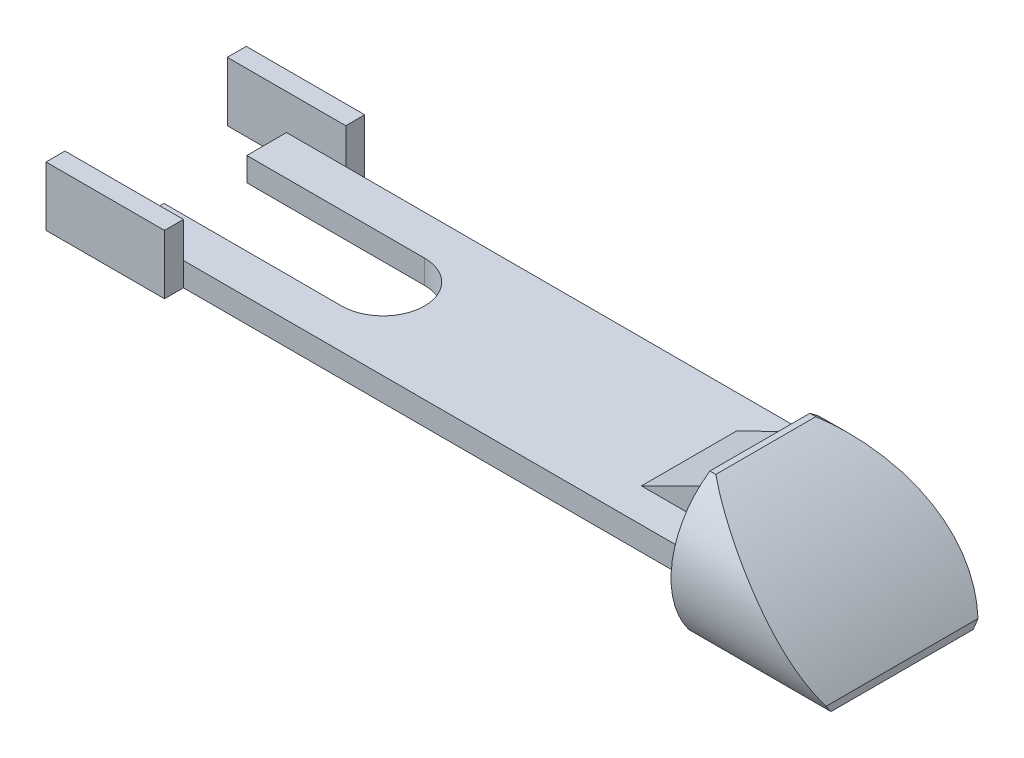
ISO-10303-21;
HEADER;
FILE_DESCRIPTION(('STEP AP214'),'2;1');
FILE_NAME('part.step','',(''),(''),'','','');
FILE_SCHEMA(('AUTOMOTIVE_DESIGN { 1 0 10303 214 1 1 1 1 }'));
ENDSEC;
DATA;
#1=APPLICATION_CONTEXT('core data for automotive mechanical design processes');
#2=APPLICATION_PROTOCOL_DEFINITION('international standard','automotive_design',2000,#1);
#3=PRODUCT_CONTEXT('',#1,'mechanical');
#4=PRODUCT('Part','Part','',(#3));
#5=PRODUCT_RELATED_PRODUCT_CATEGORY('part','',(#4));
#6=PRODUCT_DEFINITION_FORMATION('','',#4);
#7=PRODUCT_DEFINITION_CONTEXT('part definition',#1,'design');
#8=PRODUCT_DEFINITION('design','',#6,#7);
#9=PRODUCT_DEFINITION_SHAPE('','',#8);
#10=(LENGTH_UNIT() NAMED_UNIT(*) SI_UNIT(.MILLI.,.METRE.));
#11=(NAMED_UNIT(*) PLANE_ANGLE_UNIT() SI_UNIT($,.RADIAN.));
#12=(NAMED_UNIT(*) SI_UNIT($,.STERADIAN.) SOLID_ANGLE_UNIT());
#13=UNCERTAINTY_MEASURE_WITH_UNIT(LENGTH_MEASURE(1.E-05),#10,'distance_accuracy_value','');
#14=(GEOMETRIC_REPRESENTATION_CONTEXT(3) GLOBAL_UNCERTAINTY_ASSIGNED_CONTEXT((#13)) GLOBAL_UNIT_ASSIGNED_CONTEXT((#10,
#11,#12)) REPRESENTATION_CONTEXT('',''));
#15=CARTESIAN_POINT('',(0.,0.,0.));
#16=DIRECTION('',(0.,0.,1.));
#17=DIRECTION('',(1.,0.,0.));
#18=AXIS2_PLACEMENT_3D('',#15,#16,#17);
#19=CARTESIAN_POINT('',(44.958,0.,0.));
#20=DIRECTION('',(-1.,0.,0.));
#21=DIRECTION('',(0.,0.,1.));
#22=AXIS2_PLACEMENT_3D('',#19,#20,#21);
#23=CYLINDRICAL_SURFACE('',#22,9.525);
#24=CARTESIAN_POINT('',(30.353,7.87416386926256,5.3594));
#25=CARTESIAN_POINT('',(30.4711552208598,7.81522187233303,5.44599264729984));
#26=CARTESIAN_POINT('',(30.5898798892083,7.75522676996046,5.53107482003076));
#27=CARTESIAN_POINT('',(30.8282833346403,7.63316206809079,5.69835031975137));
#28=CARTESIAN_POINT('',(30.9479620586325,7.57109258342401,5.78054380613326));
#29=CARTESIAN_POINT('',(31.308113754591,7.38184070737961,6.02296434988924));
#30=CARTESIAN_POINT('',(31.5497596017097,7.2515863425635,6.17907326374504));
#31=CARTESIAN_POINT('',(32.035052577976,6.98304382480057,6.4810137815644));
#32=CARTESIAN_POINT('',(32.2787000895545,6.84475410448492,6.62684336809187));
#33=CARTESIAN_POINT('',(32.7671072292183,6.56024457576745,6.90861046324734));
#34=CARTESIAN_POINT('',(33.0118669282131,6.41402425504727,7.04454733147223));
#35=CARTESIAN_POINT('',(33.5038844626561,6.11242472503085,7.30782455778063));
#36=CARTESIAN_POINT('',(33.7511456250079,5.95697735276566,7.43508058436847));
#37=CARTESIAN_POINT('',(34.2454367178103,5.63812379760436,7.67968469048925));
#38=CARTESIAN_POINT('',(34.4924666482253,5.4747176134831,7.79703276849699));
#39=CARTESIAN_POINT('',(34.9857198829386,5.13999508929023,8.021638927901));
#40=CARTESIAN_POINT('',(35.231943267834,4.96867956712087,8.12889804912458));
#41=CARTESIAN_POINT('',(35.7230717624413,4.61818344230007,8.33301428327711));
#42=CARTESIAN_POINT('',(35.9679769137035,4.43900308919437,8.42987172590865));
#43=CARTESIAN_POINT('',(36.615350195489,3.95324570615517,8.67248355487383));
#44=CARTESIAN_POINT('',(37.0162989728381,3.63986845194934,8.80887717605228));
#45=CARTESIAN_POINT('',(37.8109947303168,2.99226483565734,9.04937884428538));
#46=CARTESIAN_POINT('',(38.204741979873,2.65803925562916,9.15348810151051));
#47=CARTESIAN_POINT('',(38.9817314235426,1.97048899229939,9.32566845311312));
#48=CARTESIAN_POINT('',(39.3649964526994,1.61721180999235,9.39382498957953));
#49=CARTESIAN_POINT('',(40.1192189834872,0.892545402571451,9.49012636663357));
#50=CARTESIAN_POINT('',(40.4901807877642,0.521162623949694,9.51828534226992));
#51=CARTESIAN_POINT('',(41.1134674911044,-0.129236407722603,9.52798760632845));
#52=CARTESIAN_POINT('',(41.3695511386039,-0.404512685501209,9.52050315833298));
#53=CARTESIAN_POINT('',(41.872621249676,-0.961562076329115,9.48045312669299));
#54=CARTESIAN_POINT('',(42.1196078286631,-1.24333510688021,9.44788786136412));
#55=CARTESIAN_POINT('',(42.6023924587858,-1.81067447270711,9.35571621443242));
#56=CARTESIAN_POINT('',(42.838220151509,-2.09622784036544,9.29618649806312));
#57=CARTESIAN_POINT('',(43.2978288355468,-2.66934219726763,9.14810373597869));
#58=CARTESIAN_POINT('',(43.5216150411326,-2.95690225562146,9.05956337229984));
#59=CARTESIAN_POINT('',(43.9563582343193,-3.53202480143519,8.85122460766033));
#60=CARTESIAN_POINT('',(44.1672752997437,-3.81958477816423,8.73133448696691));
#61=CARTESIAN_POINT('',(44.4723906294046,-4.24764006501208,8.52691519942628));
#62=CARTESIAN_POINT('',(44.572334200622,-4.38994953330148,8.45457463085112));
#63=CARTESIAN_POINT('',(44.7682182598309,-4.67287740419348,8.30154866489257));
#64=CARTESIAN_POINT('',(44.8641578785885,-4.81349543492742,8.22086146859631));
#65=CARTESIAN_POINT('',(44.958,-4.95299999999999,8.13593362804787));
#66=B_SPLINE_CURVE_WITH_KNOTS('',3,(#24,#25,#26,#27,#28,#29,#30,#31,#32,#33,#34,#35,#36,#37,#38,
#39,#40,#41,#42,#43,#44,#45,#46,#47,#48,#49,#50,#51,#52,#53,#54,#55,#56,#57,#58,#59,#60,#61,#62,
#63,#64,#65),.UNSPECIFIED.,.F.,.F.,(4,2,2,2,2,2,2,2,2,2,2,2,2,2,2,2,2,2,2,2,4),(0.,
0.473678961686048,0.947331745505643,1.89440808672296,2.84166978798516,3.78899275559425,
4.74449280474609,5.69999300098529,6.65539460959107,7.61076592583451,9.18986645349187,
10.7689077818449,12.3441793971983,13.9188941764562,15.0461534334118,16.1733983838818,
17.2974582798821,18.421027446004,19.5479213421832,20.1127498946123,20.677700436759),.UNSPECIFIED.);
#67=CARTESIAN_POINT('',(30.353,7.87416386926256,5.3594));
#68=VERTEX_POINT('',#67);
#69=CARTESIAN_POINT('',(44.958,-4.953,8.13593362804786));
#70=VERTEX_POINT('',#69);
#71=EDGE_CURVE('E241',#68,#70,#66,.T.);
#72=ORIENTED_EDGE('',*,*,#71,.F.);
#73=DIRECTION('',(-1.,0.,0.));
#74=VECTOR('',#73,1.);
#75=CARTESIAN_POINT('',(44.958,7.87416386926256,5.3594));
#76=LINE('',#75,#74);
#77=CARTESIAN_POINT('',(29.718,7.87416386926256,5.3594));
#78=VERTEX_POINT('',#77);
#79=EDGE_CURVE('E538',#68,#78,#76,.T.);
#80=ORIENTED_EDGE('',*,*,#79,.T.);
#81=CARTESIAN_POINT('',(29.718,0.,0.));
#82=DIRECTION('',(1.,0.,0.));
#83=DIRECTION('',(0.,0.,-1.));
#84=AXIS2_PLACEMENT_3D('',#81,#82,#83);
#85=CIRCLE('',#84,9.525);
#86=CARTESIAN_POINT('',(29.718,-5.715,7.62));
#87=VERTEX_POINT('',#86);
#88=EDGE_CURVE('E550',#78,#87,#85,.T.);
#89=ORIENTED_EDGE('',*,*,#88,.T.);
#90=DIRECTION('',(-1.,0.,0.));
#91=VECTOR('',#90,1.);
#92=CARTESIAN_POINT('',(44.958,-5.715,7.62));
#93=LINE('',#92,#91);
#94=CARTESIAN_POINT('',(44.958,-5.715,7.62));
#95=VERTEX_POINT('',#94);
#96=EDGE_CURVE('E473',#95,#87,#93,.T.);
#97=ORIENTED_EDGE('',*,*,#96,.F.);
#98=CARTESIAN_POINT('',(44.958,0.,0.));
#99=DIRECTION('',(1.,0.,0.));
#100=DIRECTION('',(0.,0.,-1.));
#101=AXIS2_PLACEMENT_3D('',#98,#99,#100);
#102=CIRCLE('',#101,9.525);
#103=EDGE_CURVE('E544',#70,#95,#102,.T.);
#104=ORIENTED_EDGE('',*,*,#103,.F.);
#105=EDGE_LOOP('',(#72,#80,#89,#97,#104));
#106=FACE_BOUND('',#105,.T.);
#107=ADVANCED_FACE('F32',(#106),#23,.T.);
#108=CARTESIAN_POINT('',(44.958,0.,0.));
#109=DIRECTION('',(-1.,0.,0.));
#110=DIRECTION('',(0.,0.,1.));
#111=AXIS2_PLACEMENT_3D('',#108,#109,#110);
#112=CYLINDRICAL_SURFACE('',#111,9.525);
#113=CARTESIAN_POINT('',(44.958,-4.95299999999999,-8.13593362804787));
#114=CARTESIAN_POINT('',(44.8555596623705,-4.80071180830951,-8.22864396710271));
#115=CARTESIAN_POINT('',(44.7506213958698,-4.64710154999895,-8.31629785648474));
#116=CARTESIAN_POINT('',(44.5359995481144,-4.33793147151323,-8.48166873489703));
#117=CARTESIAN_POINT('',(44.4263172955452,-4.18237220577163,-8.55938848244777));
#118=CARTESIAN_POINT('',(44.0909716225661,-3.71442206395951,-8.77763906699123));
#119=CARTESIAN_POINT('',(43.8585231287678,-3.40003313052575,-8.90369728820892));
#120=CARTESIAN_POINT('',(43.3809979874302,-2.77512849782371,-9.11767600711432));
#121=CARTESIAN_POINT('',(43.1361275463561,-2.46461621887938,-9.20607612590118));
#122=CARTESIAN_POINT('',(42.6327822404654,-1.84672505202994,-9.3496463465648));
#123=CARTESIAN_POINT('',(42.3742992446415,-1.53934817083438,-9.40479633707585));
#124=CARTESIAN_POINT('',(41.8043587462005,-0.883163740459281,-9.49060641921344));
#125=CARTESIAN_POINT('',(41.4909368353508,-0.535391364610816,-9.5160901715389));
#126=CARTESIAN_POINT('',(40.8511556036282,0.148647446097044,-9.52998367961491));
#127=CARTESIAN_POINT('',(40.5247959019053,0.484913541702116,-9.51839234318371));
#128=CARTESIAN_POINT('',(39.8595454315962,1.1455985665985,-9.46170074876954));
#129=CARTESIAN_POINT('',(39.5205945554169,1.46994031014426,-9.41641257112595));
#130=CARTESIAN_POINT('',(38.833969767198,2.10327866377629,-9.2954715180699));
#131=CARTESIAN_POINT('',(38.4862952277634,2.41227416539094,-9.2198164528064));
#132=CARTESIAN_POINT('',(37.66229577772,3.11829114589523,-9.01002780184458));
#133=CARTESIAN_POINT('',(37.1831377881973,3.50871303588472,-8.86471463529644));
#134=CARTESIAN_POINT('',(36.216242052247,4.25886692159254,-8.52974430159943));
#135=CARTESIAN_POINT('',(35.7285003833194,4.6185844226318,-8.34006634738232));
#136=CARTESIAN_POINT('',(34.7493883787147,5.30602806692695,-7.92045539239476));
#137=CARTESIAN_POINT('',(34.2580271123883,5.63381599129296,-7.6906026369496));
#138=CARTESIAN_POINT('',(33.5210737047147,6.1017129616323,-7.31672611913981));
#139=CARTESIAN_POINT('',(33.2754805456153,6.25368980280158,-7.18727639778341));
#140=CARTESIAN_POINT('',(32.7848980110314,6.54973011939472,-6.91857126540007));
#141=CARTESIAN_POINT('',(32.5399086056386,6.69379399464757,-6.77931635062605));
#142=CARTESIAN_POINT('',(31.9674074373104,7.02202454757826,-6.44125931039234));
#143=CARTESIAN_POINT('',(31.6404205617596,7.20299250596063,-6.2384187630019));
#144=CARTESIAN_POINT('',(31.1539373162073,7.46321866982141,-5.91985805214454));
#145=CARTESIAN_POINT('',(30.9926024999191,7.54801019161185,-5.81140394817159));
#146=CARTESIAN_POINT('',(30.6715076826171,7.71388815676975,-5.58933983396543));
#147=CARTESIAN_POINT('',(30.5117481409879,7.79497354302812,-5.47572837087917));
#148=CARTESIAN_POINT('',(30.353,7.87416386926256,-5.3594));
#149=B_SPLINE_CURVE_WITH_KNOTS('',3,(#113,#114,#115,#116,#117,#118,#119,#120,#121,#122,#123,
#124,#125,#126,#127,#128,#129,#130,#131,#132,#133,#134,#135,#136,#137,#138,#139,#140,#141,#142,
#143,#144,#145,#146,#147,#148),.UNSPECIFIED.,.F.,.F.,(4,2,2,2,2,2,2,2,2,2,2,2,2,2,2,2,2,4),(0.,
0.616688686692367,1.23320575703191,2.46332612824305,3.67727365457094,4.89195470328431,
6.29652739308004,7.70114146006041,9.11364801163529,10.5262564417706,12.4283549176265,
14.3313464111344,16.230579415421,17.1798617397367,18.1290960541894,19.4039986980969,
20.0401730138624,20.6765276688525),.UNSPECIFIED.);
#150=CARTESIAN_POINT('',(44.958,-4.953,-8.13593362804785));
#151=VERTEX_POINT('',#150);
#152=CARTESIAN_POINT('',(30.353,7.87416386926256,-5.3594));
#153=VERTEX_POINT('',#152);
#154=EDGE_CURVE('E233',#151,#153,#149,.T.);
#155=ORIENTED_EDGE('',*,*,#154,.F.);
#156=CARTESIAN_POINT('',(44.958,0.,0.));
#157=DIRECTION('',(1.,0.,0.));
#158=DIRECTION('',(0.,0.,-1.));
#159=AXIS2_PLACEMENT_3D('',#156,#157,#158);
#160=CIRCLE('',#159,9.525);
#161=CARTESIAN_POINT('',(44.958,-5.715,-7.62));
#162=VERTEX_POINT('',#161);
#163=EDGE_CURVE('E540',#162,#151,#160,.T.);
#164=ORIENTED_EDGE('',*,*,#163,.F.);
#165=DIRECTION('',(-1.,0.,0.));
#166=VECTOR('',#165,1.);
#167=CARTESIAN_POINT('',(44.958,-5.715,-7.62));
#168=LINE('',#167,#166);
#169=CARTESIAN_POINT('',(29.718,-5.715,-7.62));
#170=VERTEX_POINT('',#169);
#171=EDGE_CURVE('E533',#162,#170,#168,.T.);
#172=ORIENTED_EDGE('',*,*,#171,.T.);
#173=CARTESIAN_POINT('',(29.718,0.,0.));
#174=DIRECTION('',(1.,0.,0.));
#175=DIRECTION('',(0.,0.,-1.));
#176=AXIS2_PLACEMENT_3D('',#173,#174,#175);
#177=CIRCLE('',#176,9.525);
#178=CARTESIAN_POINT('',(29.718,7.87416386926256,-5.3594));
#179=VERTEX_POINT('',#178);
#180=EDGE_CURVE('E545',#170,#179,#177,.T.);
#181=ORIENTED_EDGE('',*,*,#180,.T.);
#182=DIRECTION('',(-1.,0.,0.));
#183=VECTOR('',#182,1.);
#184=CARTESIAN_POINT('',(44.958,7.87416386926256,-5.3594));
#185=LINE('',#184,#183);
#186=EDGE_CURVE('E536',#153,#179,#185,.T.);
#187=ORIENTED_EDGE('',*,*,#186,.F.);
#188=EDGE_LOOP('',(#155,#164,#172,#181,#187));
#189=FACE_BOUND('',#188,.T.);
#190=ADVANCED_FACE('F247',(#189),#112,.T.);
#191=CARTESIAN_POINT('',(44.958,7.87416386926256,5.3594));
#192=DIRECTION('',(0.,-1.,0.));
#193=DIRECTION('',(0.,0.,-1.));
#194=AXIS2_PLACEMENT_3D('',#191,#192,#193);
#195=PLANE('',#194);
#196=DIRECTION('',(0.,0.,-1.));
#197=VECTOR('',#196,1.);
#198=CARTESIAN_POINT('',(30.353,7.87416386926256,117.018032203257));
#199=LINE('',#198,#197);
#200=EDGE_CURVE('E230',#68,#153,#199,.T.);
#201=ORIENTED_EDGE('',*,*,#200,.T.);
#202=ORIENTED_EDGE('',*,*,#186,.T.);
#203=DIRECTION('',(0.,0.,1.));
#204=VECTOR('',#203,1.);
#205=CARTESIAN_POINT('',(29.718,7.87416386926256,5.3594));
#206=LINE('',#205,#204);
#207=EDGE_CURVE('E541',#179,#78,#206,.T.);
#208=ORIENTED_EDGE('',*,*,#207,.T.);
#209=ORIENTED_EDGE('',*,*,#79,.F.);
#210=EDGE_LOOP('',(#201,#202,#208,#209));
#211=FACE_BOUND('',#210,.T.);
#212=ADVANCED_FACE('F268',(#211),#195,.F.);
#213=CARTESIAN_POINT('',(-29.718,2.54,8.6995));
#214=DIRECTION('',(0.,0.,-1.));
#215=DIRECTION('',(-1.,0.,0.));
#216=AXIS2_PLACEMENT_3D('',#213,#214,#215);
#217=PLANE('',#216);
#218=DIRECTION('',(0.,1.,0.));
#219=VECTOR('',#218,1.);
#220=CARTESIAN_POINT('',(-23.368,0.,8.6995));
#221=LINE('',#220,#219);
#222=CARTESIAN_POINT('',(-23.368,0.,8.6995));
#223=VERTEX_POINT('',#222);
#224=CARTESIAN_POINT('',(-23.368,2.54,8.6995));
#225=VERTEX_POINT('',#224);
#226=EDGE_CURVE('E393',#223,#225,#221,.T.);
#227=ORIENTED_EDGE('',*,*,#226,.F.);
#228=DIRECTION('',(1.,0.,0.));
#229=VECTOR('',#228,1.);
#230=CARTESIAN_POINT('',(-29.718,0.,8.6995));
#231=LINE('',#230,#229);
#232=CARTESIAN_POINT('',(29.718,0.,8.6995));
#233=VERTEX_POINT('',#232);
#234=EDGE_CURVE('E208',#223,#233,#231,.T.);
#235=ORIENTED_EDGE('',*,*,#234,.T.);
#236=DIRECTION('',(0.,-1.,0.));
#237=VECTOR('',#236,1.);
#238=CARTESIAN_POINT('',(29.718,2.54,8.6995));
#239=LINE('',#238,#237);
#240=CARTESIAN_POINT('',(29.718,2.54,8.6995));
#241=VERTEX_POINT('',#240);
#242=EDGE_CURVE('E389',#241,#233,#239,.T.);
#243=ORIENTED_EDGE('',*,*,#242,.F.);
#244=DIRECTION('',(1.,0.,0.));
#245=VECTOR('',#244,1.);
#246=CARTESIAN_POINT('',(-29.718,2.54,8.6995));
#247=LINE('',#246,#245);
#248=EDGE_CURVE('E448',#225,#241,#247,.T.);
#249=ORIENTED_EDGE('',*,*,#248,.F.);
#250=EDGE_LOOP('',(#227,#235,#243,#249));
#251=FACE_BOUND('',#250,.T.);
#252=ADVANCED_FACE('F270',(#251),#217,.F.);
#253=CARTESIAN_POINT('',(-29.718,2.54,8.6995));
#254=DIRECTION('',(1.,0.,0.));
#255=DIRECTION('',(0.,0.,-1.));
#256=AXIS2_PLACEMENT_3D('',#253,#254,#255);
#257=PLANE('',#256);
#258=DIRECTION('',(0.,0.,1.));
#259=VECTOR('',#258,1.);
#260=CARTESIAN_POINT('',(-29.718,0.,8.6995));
#261=LINE('',#260,#259);
#262=CARTESIAN_POINT('',(-29.718,0.,-8.6995));
#263=VERTEX_POINT('',#262);
#264=CARTESIAN_POINT('',(-29.718,0.,-4.445));
#265=VERTEX_POINT('',#264);
#266=EDGE_CURVE('E36',#263,#265,#261,.T.);
#267=ORIENTED_EDGE('',*,*,#266,.T.);
#268=DIRECTION('',(0.,1.,0.));
#269=VECTOR('',#268,1.);
#270=CARTESIAN_POINT('',(-29.718,0.,-4.445));
#271=LINE('',#270,#269);
#272=CARTESIAN_POINT('',(-29.718,2.54,-4.445));
#273=VERTEX_POINT('',#272);
#274=EDGE_CURVE('E359',#265,#273,#271,.T.);
#275=ORIENTED_EDGE('',*,*,#274,.T.);
#276=DIRECTION('',(0.,0.,1.));
#277=VECTOR('',#276,1.);
#278=CARTESIAN_POINT('',(-29.718,2.54,8.6995));
#279=LINE('',#278,#277);
#280=CARTESIAN_POINT('',(-29.718,2.54,-8.6995));
#281=VERTEX_POINT('',#280);
#282=EDGE_CURVE('E446',#281,#273,#279,.T.);
#283=ORIENTED_EDGE('',*,*,#282,.F.);
#284=DIRECTION('',(0.,-1.,0.));
#285=VECTOR('',#284,1.);
#286=CARTESIAN_POINT('',(-29.718,2.54,-8.6995));
#287=LINE('',#286,#285);
#288=EDGE_CURVE('E361',#281,#263,#287,.T.);
#289=ORIENTED_EDGE('',*,*,#288,.T.);
#290=EDGE_LOOP('',(#267,#275,#283,#289));
#291=FACE_BOUND('',#290,.T.);
#292=ADVANCED_FACE('F276',(#291),#257,.F.);
#293=CARTESIAN_POINT('',(-29.718,2.54,-8.6995));
#294=DIRECTION('',(0.,0.,1.));
#295=DIRECTION('',(1.,0.,0.));
#296=AXIS2_PLACEMENT_3D('',#293,#294,#295);
#297=PLANE('',#296);
#298=DIRECTION('',(-1.,0.,0.));
#299=VECTOR('',#298,1.);
#300=CARTESIAN_POINT('',(-29.718,0.,-8.6995));
#301=LINE('',#300,#299);
#302=CARTESIAN_POINT('',(29.718,0.,-8.6995));
#303=VERTEX_POINT('',#302);
#304=CARTESIAN_POINT('',(-23.368,0.,-8.6995));
#305=VERTEX_POINT('',#304);
#306=EDGE_CURVE('E366',#303,#305,#301,.T.);
#307=ORIENTED_EDGE('',*,*,#306,.T.);
#308=DIRECTION('',(0.,1.,0.));
#309=VECTOR('',#308,1.);
#310=CARTESIAN_POINT('',(-23.368,0.,-8.6995));
#311=LINE('',#310,#309);
#312=CARTESIAN_POINT('',(-23.368,2.54,-8.6995));
#313=VERTEX_POINT('',#312);
#314=EDGE_CURVE('E465',#305,#313,#311,.T.);
#315=ORIENTED_EDGE('',*,*,#314,.T.);
#316=DIRECTION('',(-1.,0.,0.));
#317=VECTOR('',#316,1.);
#318=CARTESIAN_POINT('',(-29.718,2.54,-8.6995));
#319=LINE('',#318,#317);
#320=CARTESIAN_POINT('',(29.718,2.54,-8.6995));
#321=VERTEX_POINT('',#320);
#322=EDGE_CURVE('E443',#321,#313,#319,.T.);
#323=ORIENTED_EDGE('',*,*,#322,.F.);
#324=DIRECTION('',(0.,-1.,0.));
#325=VECTOR('',#324,1.);
#326=CARTESIAN_POINT('',(29.718,2.54,-8.6995));
#327=LINE('',#326,#325);
#328=EDGE_CURVE('E42',#321,#303,#327,.T.);
#329=ORIENTED_EDGE('',*,*,#328,.T.);
#330=EDGE_LOOP('',(#307,#315,#323,#329));
#331=FACE_BOUND('',#330,.T.);
#332=ADVANCED_FACE('F34',(#331),#297,.F.);
#333=CARTESIAN_POINT('',(-29.718,2.54,4.445));
#334=VERTEX_POINT('',#333);
#335=CARTESIAN_POINT('',(-29.718,2.54,8.6995));
#336=VERTEX_POINT('',#335);
#337=EDGE_CURVE('E445',#334,#336,#279,.T.);
#338=ORIENTED_EDGE('',*,*,#337,.F.);
#339=DIRECTION('',(0.,1.,0.));
#340=VECTOR('',#339,1.);
#341=CARTESIAN_POINT('',(-29.718,0.,4.445));
#342=LINE('',#341,#340);
#343=CARTESIAN_POINT('',(-29.718,0.,4.445));
#344=VERTEX_POINT('',#343);
#345=EDGE_CURVE('E428',#344,#334,#342,.T.);
#346=ORIENTED_EDGE('',*,*,#345,.F.);
#347=CARTESIAN_POINT('',(-29.718,0.,8.6995));
#348=VERTEX_POINT('',#347);
#349=EDGE_CURVE('E364',#344,#348,#261,.T.);
#350=ORIENTED_EDGE('',*,*,#349,.T.);
#351=DIRECTION('',(0.,-1.,0.));
#352=VECTOR('',#351,1.);
#353=CARTESIAN_POINT('',(-29.718,2.54,8.6995));
#354=LINE('',#353,#352);
#355=EDGE_CURVE('E379',#336,#348,#354,.T.);
#356=ORIENTED_EDGE('',*,*,#355,.F.);
#357=EDGE_LOOP('',(#338,#346,#350,#356));
#358=FACE_BOUND('',#357,.T.);
#359=ADVANCED_FACE('F340',(#358),#257,.F.);
#360=CARTESIAN_POINT('',(29.718,2.54,-8.6995));
#361=DIRECTION('',(0.,-1.,0.));
#362=DIRECTION('',(0.,0.,-1.));
#363=AXIS2_PLACEMENT_3D('',#360,#361,#362);
#364=PLANE('',#363);
#365=DIRECTION('',(0.,0.,-1.));
#366=VECTOR('',#365,1.);
#367=CARTESIAN_POINT('',(29.718,2.54,8.6995));
#368=LINE('',#367,#366);
#369=CARTESIAN_POINT('',(29.718,2.54,5.08));
#370=VERTEX_POINT('',#369);
#371=EDGE_CURVE('E207',#241,#370,#368,.T.);
#372=ORIENTED_EDGE('',*,*,#371,.T.);
#373=DIRECTION('',(-1.,0.,0.));
#374=VECTOR('',#373,1.);
#375=CARTESIAN_POINT('',(29.718,2.54,5.08));
#376=LINE('',#375,#374);
#377=CARTESIAN_POINT('',(22.098,2.54,5.08));
#378=VERTEX_POINT('',#377);
#379=EDGE_CURVE('E50',#370,#378,#376,.T.);
#380=ORIENTED_EDGE('',*,*,#379,.T.);
#381=DIRECTION('',(0.,0.,-1.));
#382=VECTOR('',#381,1.);
#383=CARTESIAN_POINT('',(22.098,2.54,-8.6995));
#384=LINE('',#383,#382);
#385=CARTESIAN_POINT('',(22.098,2.54,-5.08));
#386=VERTEX_POINT('',#385);
#387=EDGE_CURVE('E54',#378,#386,#384,.T.);
#388=ORIENTED_EDGE('',*,*,#387,.T.);
#389=DIRECTION('',(-1.,0.,0.));
#390=VECTOR('',#389,1.);
#391=CARTESIAN_POINT('',(29.718,2.54,-5.08));
#392=LINE('',#391,#390);
#393=CARTESIAN_POINT('',(29.718,2.54,-5.08));
#394=VERTEX_POINT('',#393);
#395=EDGE_CURVE('E210',#394,#386,#392,.T.);
#396=ORIENTED_EDGE('',*,*,#395,.F.);
#397=EDGE_CURVE('E199',#394,#321,#368,.T.);
#398=ORIENTED_EDGE('',*,*,#397,.T.);
#399=ORIENTED_EDGE('',*,*,#322,.T.);
#400=EDGE_CURVE('E442',#313,#281,#319,.T.);
#401=ORIENTED_EDGE('',*,*,#400,.T.);
#402=ORIENTED_EDGE('',*,*,#282,.T.);
#403=DIRECTION('',(-1.,0.,0.));
#404=VECTOR('',#403,1.);
#405=CARTESIAN_POINT('',(-29.718,2.54,-4.445));
#406=LINE('',#405,#404);
#407=CARTESIAN_POINT('',(-10.668,2.54,-4.445));
#408=VERTEX_POINT('',#407);
#409=EDGE_CURVE('E423',#408,#273,#406,.T.);
#410=ORIENTED_EDGE('',*,*,#409,.F.);
#411=CARTESIAN_POINT('',(-10.668,2.54,0.));
#412=DIRECTION('',(0.,1.,0.));
#413=DIRECTION('',(0.,0.,-1.));
#414=AXIS2_PLACEMENT_3D('',#411,#412,#413);
#415=CIRCLE('',#414,4.445);
#416=CARTESIAN_POINT('',(-10.668,2.54,4.445));
#417=VERTEX_POINT('',#416);
#418=EDGE_CURVE('E432',#417,#408,#415,.T.);
#419=ORIENTED_EDGE('',*,*,#418,.F.);
#420=DIRECTION('',(1.,0.,0.));
#421=VECTOR('',#420,1.);
#422=CARTESIAN_POINT('',(-29.718,2.54,4.445));
#423=LINE('',#422,#421);
#424=EDGE_CURVE('E429',#334,#417,#423,.T.);
#425=ORIENTED_EDGE('',*,*,#424,.F.);
#426=ORIENTED_EDGE('',*,*,#337,.T.);
#427=EDGE_CURVE('E449',#336,#225,#247,.T.);
#428=ORIENTED_EDGE('',*,*,#427,.T.);
#429=ORIENTED_EDGE('',*,*,#248,.T.);
#430=EDGE_LOOP('',(#372,#380,#388,#396,#398,#399,#401,#402,#410,#419,#425,#426,#428,#429));
#431=FACE_BOUND('',#430,.T.);
#432=ADVANCED_FACE('F211',(#431),#364,.F.);
#433=CARTESIAN_POINT('',(29.718,0.,-8.6995));
#434=DIRECTION('',(0.,-1.,0.));
#435=DIRECTION('',(0.,0.,-1.));
#436=AXIS2_PLACEMENT_3D('',#433,#434,#435);
#437=PLANE('',#436);
#438=ORIENTED_EDGE('',*,*,#306,.F.);
#439=DIRECTION('',(0.,0.,-1.));
#440=VECTOR('',#439,1.);
#441=CARTESIAN_POINT('',(29.718,0.,8.6995));
#442=LINE('',#441,#440);
#443=EDGE_CURVE('E373',#233,#303,#442,.T.);
#444=ORIENTED_EDGE('',*,*,#443,.F.);
#445=ORIENTED_EDGE('',*,*,#234,.F.);
#446=DIRECTION('',(0.,0.,-1.));
#447=VECTOR('',#446,1.);
#448=CARTESIAN_POINT('',(-23.368,0.,10.7315));
#449=LINE('',#448,#447);
#450=CARTESIAN_POINT('',(-23.368,0.,10.7315));
#451=VERTEX_POINT('',#450);
#452=EDGE_CURVE('E398',#451,#223,#449,.T.);
#453=ORIENTED_EDGE('',*,*,#452,.F.);
#454=DIRECTION('',(1.,0.,0.));
#455=VECTOR('',#454,1.);
#456=CARTESIAN_POINT('',(-23.368,0.,10.7315));
#457=LINE('',#456,#455);
#458=CARTESIAN_POINT('',(-36.068,0.,10.7315));
#459=VERTEX_POINT('',#458);
#460=EDGE_CURVE('E403',#459,#451,#457,.T.);
#461=ORIENTED_EDGE('',*,*,#460,.F.);
#462=DIRECTION('',(0.,0.,-1.));
#463=VECTOR('',#462,1.);
#464=CARTESIAN_POINT('',(-36.068,0.,10.7315));
#465=LINE('',#464,#463);
#466=CARTESIAN_POINT('',(-36.068,0.,8.6995));
#467=VERTEX_POINT('',#466);
#468=EDGE_CURVE('E411',#459,#467,#465,.T.);
#469=ORIENTED_EDGE('',*,*,#468,.T.);
#470=DIRECTION('',(1.,0.,0.));
#471=VECTOR('',#470,1.);
#472=CARTESIAN_POINT('',(-23.368,0.,8.6995));
#473=LINE('',#472,#471);
#474=EDGE_CURVE('E408',#467,#348,#473,.T.);
#475=ORIENTED_EDGE('',*,*,#474,.T.);
#476=ORIENTED_EDGE('',*,*,#349,.F.);
#477=DIRECTION('',(1.,0.,0.));
#478=VECTOR('',#477,1.);
#479=CARTESIAN_POINT('',(-29.718,0.,4.445));
#480=LINE('',#479,#478);
#481=CARTESIAN_POINT('',(-10.668,0.,4.445));
#482=VERTEX_POINT('',#481);
#483=EDGE_CURVE('E419',#344,#482,#480,.T.);
#484=ORIENTED_EDGE('',*,*,#483,.T.);
#485=CARTESIAN_POINT('',(-10.668,0.,0.));
#486=DIRECTION('',(0.,1.,0.));
#487=DIRECTION('',(0.,0.,-1.));
#488=AXIS2_PLACEMENT_3D('',#485,#486,#487);
#489=CIRCLE('',#488,4.445);
#490=CARTESIAN_POINT('',(-10.668,0.,-4.445));
#491=VERTEX_POINT('',#490);
#492=EDGE_CURVE('E422',#482,#491,#489,.T.);
#493=ORIENTED_EDGE('',*,*,#492,.T.);
#494=DIRECTION('',(-1.,0.,0.));
#495=VECTOR('',#494,1.);
#496=CARTESIAN_POINT('',(-29.718,0.,-4.445));
#497=LINE('',#496,#495);
#498=EDGE_CURVE('E426',#491,#265,#497,.T.);
#499=ORIENTED_EDGE('',*,*,#498,.T.);
#500=ORIENTED_EDGE('',*,*,#266,.F.);
#501=DIRECTION('',(1.,0.,0.));
#502=VECTOR('',#501,1.);
#503=CARTESIAN_POINT('',(-23.368,0.,-8.6995));
#504=LINE('',#503,#502);
#505=CARTESIAN_POINT('',(-36.068,0.,-8.6995));
#506=VERTEX_POINT('',#505);
#507=EDGE_CURVE('E469',#506,#263,#504,.T.);
#508=ORIENTED_EDGE('',*,*,#507,.F.);
#509=DIRECTION('',(0.,0.,1.));
#510=VECTOR('',#509,1.);
#511=CARTESIAN_POINT('',(-36.068,0.,-10.7315));
#512=LINE('',#511,#510);
#513=CARTESIAN_POINT('',(-36.068,0.,-10.7315));
#514=VERTEX_POINT('',#513);
#515=EDGE_CURVE('E463',#514,#506,#512,.T.);
#516=ORIENTED_EDGE('',*,*,#515,.F.);
#517=DIRECTION('',(1.,0.,0.));
#518=VECTOR('',#517,1.);
#519=CARTESIAN_POINT('',(-23.368,0.,-10.7315));
#520=LINE('',#519,#518);
#521=CARTESIAN_POINT('',(-23.368,0.,-10.7315));
#522=VERTEX_POINT('',#521);
#523=EDGE_CURVE('E460',#514,#522,#520,.T.);
#524=ORIENTED_EDGE('',*,*,#523,.T.);
#525=DIRECTION('',(0.,0.,1.));
#526=VECTOR('',#525,1.);
#527=CARTESIAN_POINT('',(-23.368,0.,-10.7315));
#528=LINE('',#527,#526);
#529=EDGE_CURVE('E402',#522,#305,#528,.T.);
#530=ORIENTED_EDGE('',*,*,#529,.T.);
#531=EDGE_LOOP('',(#438,#444,#445,#453,#461,#469,#475,#476,#484,#493,#499,#500,#508,#516,#524,#530));
#532=FACE_BOUND('',#531,.T.);
#533=ADVANCED_FACE('F330',(#532),#437,.T.);
#534=CARTESIAN_POINT('',(-29.718,0.,-4.445));
#535=DIRECTION('',(0.,0.,-1.));
#536=DIRECTION('',(-1.,0.,0.));
#537=AXIS2_PLACEMENT_3D('',#534,#535,#536);
#538=PLANE('',#537);
#539=ORIENTED_EDGE('',*,*,#409,.T.);
#540=ORIENTED_EDGE('',*,*,#274,.F.);
#541=ORIENTED_EDGE('',*,*,#498,.F.);
#542=DIRECTION('',(0.,1.,0.));
#543=VECTOR('',#542,1.);
#544=CARTESIAN_POINT('',(-10.668,0.,-4.445));
#545=LINE('',#544,#543);
#546=EDGE_CURVE('E437',#491,#408,#545,.T.);
#547=ORIENTED_EDGE('',*,*,#546,.T.);
#548=EDGE_LOOP('',(#539,#540,#541,#547));
#549=FACE_BOUND('',#548,.T.);
#550=ADVANCED_FACE('F326',(#549),#538,.F.);
#551=CARTESIAN_POINT('',(-10.668,0.,0.));
#552=DIRECTION('',(0.,1.,0.));
#553=DIRECTION('',(0.,0.,1.));
#554=AXIS2_PLACEMENT_3D('',#551,#552,#553);
#555=CYLINDRICAL_SURFACE('',#554,4.445);
#556=ORIENTED_EDGE('',*,*,#418,.T.);
#557=ORIENTED_EDGE('',*,*,#546,.F.);
#558=ORIENTED_EDGE('',*,*,#492,.F.);
#559=DIRECTION('',(0.,1.,0.));
#560=VECTOR('',#559,1.);
#561=CARTESIAN_POINT('',(-10.668,0.,4.445));
#562=LINE('',#561,#560);
#563=EDGE_CURVE('E439',#482,#417,#562,.T.);
#564=ORIENTED_EDGE('',*,*,#563,.T.);
#565=EDGE_LOOP('',(#556,#557,#558,#564));
#566=FACE_BOUND('',#565,.T.);
#567=ADVANCED_FACE('F329',(#566),#555,.F.);
#568=CARTESIAN_POINT('',(-29.718,0.,4.445));
#569=DIRECTION('',(0.,0.,1.));
#570=DIRECTION('',(1.,0.,0.));
#571=AXIS2_PLACEMENT_3D('',#568,#569,#570);
#572=PLANE('',#571);
#573=ORIENTED_EDGE('',*,*,#424,.T.);
#574=ORIENTED_EDGE('',*,*,#563,.F.);
#575=ORIENTED_EDGE('',*,*,#483,.F.);
#576=ORIENTED_EDGE('',*,*,#345,.T.);
#577=EDGE_LOOP('',(#573,#574,#575,#576));
#578=FACE_BOUND('',#577,.T.);
#579=ADVANCED_FACE('F324',(#578),#572,.F.);
#580=CARTESIAN_POINT('',(-23.368,0.,10.7315));
#581=DIRECTION('',(-1.,0.,0.));
#582=DIRECTION('',(0.,0.,1.));
#583=AXIS2_PLACEMENT_3D('',#580,#581,#582);
#584=PLANE('',#583);
#585=ORIENTED_EDGE('',*,*,#226,.T.);
#586=CARTESIAN_POINT('',(-23.368,6.35,8.6995));
#587=VERTEX_POINT('',#586);
#588=EDGE_CURVE('E397',#225,#587,#221,.T.);
#589=ORIENTED_EDGE('',*,*,#588,.T.);
#590=DIRECTION('',(0.,0.,-1.));
#591=VECTOR('',#590,1.);
#592=CARTESIAN_POINT('',(-23.368,6.35,10.7315));
#593=LINE('',#592,#591);
#594=CARTESIAN_POINT('',(-23.368,6.35,10.7315));
#595=VERTEX_POINT('',#594);
#596=EDGE_CURVE('E418',#595,#587,#593,.T.);
#597=ORIENTED_EDGE('',*,*,#596,.F.);
#598=DIRECTION('',(0.,1.,0.));
#599=VECTOR('',#598,1.);
#600=CARTESIAN_POINT('',(-23.368,0.,10.7315));
#601=LINE('',#600,#599);
#602=EDGE_CURVE('E417',#451,#595,#601,.T.);
#603=ORIENTED_EDGE('',*,*,#602,.F.);
#604=ORIENTED_EDGE('',*,*,#452,.T.);
#605=EDGE_LOOP('',(#585,#589,#597,#603,#604));
#606=FACE_BOUND('',#605,.T.);
#607=ADVANCED_FACE('F320',(#606),#584,.F.);
#608=CARTESIAN_POINT('',(-23.368,6.35,10.7315));
#609=DIRECTION('',(0.,-1.,0.));
#610=DIRECTION('',(1.,0.,0.));
#611=AXIS2_PLACEMENT_3D('',#608,#609,#610);
#612=PLANE('',#611);
#613=DIRECTION('',(-1.,0.,0.));
#614=VECTOR('',#613,1.);
#615=CARTESIAN_POINT('',(-23.368,6.35,8.6995));
#616=LINE('',#615,#614);
#617=CARTESIAN_POINT('',(-36.068,6.35,8.6995));
#618=VERTEX_POINT('',#617);
#619=EDGE_CURVE('E396',#587,#618,#616,.T.);
#620=ORIENTED_EDGE('',*,*,#619,.T.);
#621=DIRECTION('',(0.,0.,-1.));
#622=VECTOR('',#621,1.);
#623=CARTESIAN_POINT('',(-36.068,6.35,10.7315));
#624=LINE('',#623,#622);
#625=CARTESIAN_POINT('',(-36.068,6.35,10.7315));
#626=VERTEX_POINT('',#625);
#627=EDGE_CURVE('E499',#626,#618,#624,.T.);
#628=ORIENTED_EDGE('',*,*,#627,.F.);
#629=DIRECTION('',(-1.,0.,0.));
#630=VECTOR('',#629,1.);
#631=CARTESIAN_POINT('',(-23.368,6.35,10.7315));
#632=LINE('',#631,#630);
#633=EDGE_CURVE('E490',#595,#626,#632,.T.);
#634=ORIENTED_EDGE('',*,*,#633,.F.);
#635=ORIENTED_EDGE('',*,*,#596,.T.);
#636=EDGE_LOOP('',(#620,#628,#634,#635));
#637=FACE_BOUND('',#636,.T.);
#638=ADVANCED_FACE('F316',(#637),#612,.F.);
#639=CARTESIAN_POINT('',(-36.068,0.,10.7315));
#640=DIRECTION('',(1.,0.,0.));
#641=DIRECTION('',(0.,0.,-1.));
#642=AXIS2_PLACEMENT_3D('',#639,#640,#641);
#643=PLANE('',#642);
#644=DIRECTION('',(0.,-1.,0.));
#645=VECTOR('',#644,1.);
#646=CARTESIAN_POINT('',(-36.068,0.,8.6995));
#647=LINE('',#646,#645);
#648=EDGE_CURVE('E406',#618,#467,#647,.T.);
#649=ORIENTED_EDGE('',*,*,#648,.T.);
#650=ORIENTED_EDGE('',*,*,#468,.F.);
#651=DIRECTION('',(0.,-1.,0.));
#652=VECTOR('',#651,1.);
#653=CARTESIAN_POINT('',(-36.068,0.,10.7315));
#654=LINE('',#653,#652);
#655=EDGE_CURVE('E491',#626,#459,#654,.T.);
#656=ORIENTED_EDGE('',*,*,#655,.F.);
#657=ORIENTED_EDGE('',*,*,#627,.T.);
#658=EDGE_LOOP('',(#649,#650,#656,#657));
#659=FACE_BOUND('',#658,.T.);
#660=ADVANCED_FACE('F309',(#659),#643,.F.);
#661=CARTESIAN_POINT('',(-23.368,6.35,10.7315));
#662=DIRECTION('',(0.,0.,1.));
#663=DIRECTION('',(1.,0.,0.));
#664=AXIS2_PLACEMENT_3D('',#661,#662,#663);
#665=PLANE('',#664);
#666=ORIENTED_EDGE('',*,*,#602,.T.);
#667=ORIENTED_EDGE('',*,*,#633,.T.);
#668=ORIENTED_EDGE('',*,*,#655,.T.);
#669=ORIENTED_EDGE('',*,*,#460,.T.);
#670=EDGE_LOOP('',(#666,#667,#668,#669));
#671=FACE_BOUND('',#670,.T.);
#672=ADVANCED_FACE('F306',(#671),#665,.T.);
#673=CARTESIAN_POINT('',(-23.368,6.35,8.6995));
#674=DIRECTION('',(0.,0.,1.));
#675=DIRECTION('',(1.,0.,0.));
#676=AXIS2_PLACEMENT_3D('',#673,#674,#675);
#677=PLANE('',#676);
#678=ORIENTED_EDGE('',*,*,#427,.F.);
#679=ORIENTED_EDGE('',*,*,#355,.T.);
#680=ORIENTED_EDGE('',*,*,#474,.F.);
#681=ORIENTED_EDGE('',*,*,#648,.F.);
#682=ORIENTED_EDGE('',*,*,#619,.F.);
#683=ORIENTED_EDGE('',*,*,#588,.F.);
#684=EDGE_LOOP('',(#678,#679,#680,#681,#682,#683));
#685=FACE_BOUND('',#684,.T.);
#686=ADVANCED_FACE('F304',(#685),#677,.F.);
#687=CARTESIAN_POINT('',(-23.368,0.,-10.7315));
#688=DIRECTION('',(1.,0.,0.));
#689=DIRECTION('',(0.,0.,-1.));
#690=AXIS2_PLACEMENT_3D('',#687,#688,#689);
#691=PLANE('',#690);
#692=ORIENTED_EDGE('',*,*,#314,.F.);
#693=ORIENTED_EDGE('',*,*,#529,.F.);
#694=DIRECTION('',(0.,1.,0.));
#695=VECTOR('',#694,1.);
#696=CARTESIAN_POINT('',(-23.368,0.,-10.7315));
#697=LINE('',#696,#695);
#698=CARTESIAN_POINT('',(-23.368,6.35,-10.7315));
#699=VERTEX_POINT('',#698);
#700=EDGE_CURVE('E525',#522,#699,#697,.T.);
#701=ORIENTED_EDGE('',*,*,#700,.T.);
#702=DIRECTION('',(0.,0.,1.));
#703=VECTOR('',#702,1.);
#704=CARTESIAN_POINT('',(-23.368,6.35,-10.7315));
#705=LINE('',#704,#703);
#706=CARTESIAN_POINT('',(-23.368,6.35,-8.6995));
#707=VERTEX_POINT('',#706);
#708=EDGE_CURVE('E527',#699,#707,#705,.T.);
#709=ORIENTED_EDGE('',*,*,#708,.T.);
#710=EDGE_CURVE('E467',#313,#707,#311,.T.);
#711=ORIENTED_EDGE('',*,*,#710,.F.);
#712=EDGE_LOOP('',(#692,#693,#701,#709,#711));
#713=FACE_BOUND('',#712,.T.);
#714=ADVANCED_FACE('F300',(#713),#691,.T.);
#715=CARTESIAN_POINT('',(-36.068,0.,-10.7315));
#716=DIRECTION('',(-1.,0.,0.));
#717=DIRECTION('',(0.,0.,1.));
#718=AXIS2_PLACEMENT_3D('',#715,#716,#717);
#719=PLANE('',#718);
#720=DIRECTION('',(0.,-1.,0.));
#721=VECTOR('',#720,1.);
#722=CARTESIAN_POINT('',(-36.068,0.,-8.6995));
#723=LINE('',#722,#721);
#724=CARTESIAN_POINT('',(-36.068,6.35,-8.6995));
#725=VERTEX_POINT('',#724);
#726=EDGE_CURVE('E471',#725,#506,#723,.T.);
#727=ORIENTED_EDGE('',*,*,#726,.F.);
#728=DIRECTION('',(0.,0.,1.));
#729=VECTOR('',#728,1.);
#730=CARTESIAN_POINT('',(-36.068,6.35,-10.7315));
#731=LINE('',#730,#729);
#732=CARTESIAN_POINT('',(-36.068,6.35,-10.7315));
#733=VERTEX_POINT('',#732);
#734=EDGE_CURVE('E520',#733,#725,#731,.T.);
#735=ORIENTED_EDGE('',*,*,#734,.F.);
#736=DIRECTION('',(0.,-1.,0.));
#737=VECTOR('',#736,1.);
#738=CARTESIAN_POINT('',(-36.068,0.,-10.7315));
#739=LINE('',#738,#737);
#740=EDGE_CURVE('E523',#733,#514,#739,.T.);
#741=ORIENTED_EDGE('',*,*,#740,.T.);
#742=ORIENTED_EDGE('',*,*,#515,.T.);
#743=EDGE_LOOP('',(#727,#735,#741,#742));
#744=FACE_BOUND('',#743,.T.);
#745=ADVANCED_FACE('F296',(#744),#719,.T.);
#746=CARTESIAN_POINT('',(-23.368,6.35,-10.7315));
#747=DIRECTION('',(0.,1.,0.));
#748=DIRECTION('',(-1.,0.,0.));
#749=AXIS2_PLACEMENT_3D('',#746,#747,#748);
#750=PLANE('',#749);
#751=DIRECTION('',(-1.,0.,0.));
#752=VECTOR('',#751,1.);
#753=CARTESIAN_POINT('',(-23.368,6.35,-8.6995));
#754=LINE('',#753,#752);
#755=EDGE_CURVE('E530',#707,#725,#754,.T.);
#756=ORIENTED_EDGE('',*,*,#755,.F.);
#757=ORIENTED_EDGE('',*,*,#708,.F.);
#758=DIRECTION('',(-1.,0.,0.));
#759=VECTOR('',#758,1.);
#760=CARTESIAN_POINT('',(-23.368,6.35,-10.7315));
#761=LINE('',#760,#759);
#762=EDGE_CURVE('E480',#699,#733,#761,.T.);
#763=ORIENTED_EDGE('',*,*,#762,.T.);
#764=ORIENTED_EDGE('',*,*,#734,.T.);
#765=EDGE_LOOP('',(#756,#757,#763,#764));
#766=FACE_BOUND('',#765,.T.);
#767=ADVANCED_FACE('F289',(#766),#750,.T.);
#768=CARTESIAN_POINT('',(-23.368,6.35,-10.7315));
#769=DIRECTION('',(0.,0.,-1.));
#770=DIRECTION('',(1.,0.,0.));
#771=AXIS2_PLACEMENT_3D('',#768,#769,#770);
#772=PLANE('',#771);
#773=ORIENTED_EDGE('',*,*,#700,.F.);
#774=ORIENTED_EDGE('',*,*,#523,.F.);
#775=ORIENTED_EDGE('',*,*,#740,.F.);
#776=ORIENTED_EDGE('',*,*,#762,.F.);
#777=EDGE_LOOP('',(#773,#774,#775,#776));
#778=FACE_BOUND('',#777,.T.);
#779=ADVANCED_FACE('F286',(#778),#772,.T.);
#780=CARTESIAN_POINT('',(-23.368,6.35,-8.6995));
#781=DIRECTION('',(0.,0.,-1.));
#782=DIRECTION('',(1.,0.,0.));
#783=AXIS2_PLACEMENT_3D('',#780,#781,#782);
#784=PLANE('',#783);
#785=ORIENTED_EDGE('',*,*,#288,.F.);
#786=ORIENTED_EDGE('',*,*,#400,.F.);
#787=ORIENTED_EDGE('',*,*,#710,.T.);
#788=ORIENTED_EDGE('',*,*,#755,.T.);
#789=ORIENTED_EDGE('',*,*,#726,.T.);
#790=ORIENTED_EDGE('',*,*,#507,.T.);
#791=EDGE_LOOP('',(#785,#786,#787,#788,#789,#790));
#792=FACE_BOUND('',#791,.T.);
#793=ADVANCED_FACE('F266',(#792),#784,.F.);
#794=CARTESIAN_POINT('',(29.718,0.,0.));
#795=DIRECTION('',(1.,0.,0.));
#796=DIRECTION('',(0.,0.,-1.));
#797=AXIS2_PLACEMENT_3D('',#794,#795,#796);
#798=PLANE('',#797);
#799=ORIENTED_EDGE('',*,*,#180,.F.);
#800=DIRECTION('',(0.,0.,-1.));
#801=VECTOR('',#800,1.);
#802=CARTESIAN_POINT('',(29.718,-5.715,7.62));
#803=LINE('',#802,#801);
#804=EDGE_CURVE('E548',#87,#170,#803,.T.);
#805=ORIENTED_EDGE('',*,*,#804,.F.);
#806=ORIENTED_EDGE('',*,*,#88,.F.);
#807=ORIENTED_EDGE('',*,*,#207,.F.);
#808=EDGE_LOOP('',(#799,#805,#806,#807));
#809=FACE_BOUND('',#808,.T.);
#810=ORIENTED_EDGE('',*,*,#443,.T.);
#811=ORIENTED_EDGE('',*,*,#328,.F.);
#812=ORIENTED_EDGE('',*,*,#397,.F.);
#813=DIRECTION('',(0.,-1.,0.));
#814=VECTOR('',#813,1.);
#815=CARTESIAN_POINT('',(29.718,0.,-5.08));
#816=LINE('',#815,#814);
#817=CARTESIAN_POINT('',(29.718,6.3266450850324,-5.08));
#818=VERTEX_POINT('',#817);
#819=EDGE_CURVE('E202',#818,#394,#816,.T.);
#820=ORIENTED_EDGE('',*,*,#819,.F.);
#821=DIRECTION('',(0.,0.,1.));
#822=VECTOR('',#821,1.);
#823=CARTESIAN_POINT('',(29.718,6.3266450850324,0.));
#824=LINE('',#823,#822);
#825=CARTESIAN_POINT('',(29.718,6.3266450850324,5.08));
#826=VERTEX_POINT('',#825);
#827=EDGE_CURVE('E228',#818,#826,#824,.T.);
#828=ORIENTED_EDGE('',*,*,#827,.T.);
#829=DIRECTION('',(0.,-1.,0.));
#830=VECTOR('',#829,1.);
#831=CARTESIAN_POINT('',(29.718,0.,5.08));
#832=LINE('',#831,#830);
#833=EDGE_CURVE('E215',#826,#370,#832,.T.);
#834=ORIENTED_EDGE('',*,*,#833,.T.);
#835=ORIENTED_EDGE('',*,*,#371,.F.);
#836=ORIENTED_EDGE('',*,*,#242,.T.);
#837=EDGE_LOOP('',(#810,#811,#812,#820,#828,#834,#835,#836));
#838=FACE_BOUND('',#837,.T.);
#839=ADVANCED_FACE('F200',(#809,#838),#798,.F.);
#840=CARTESIAN_POINT('',(44.958,-5.715,7.62));
#841=DIRECTION('',(0.,1.,0.));
#842=DIRECTION('',(0.,0.,1.));
#843=AXIS2_PLACEMENT_3D('',#840,#841,#842);
#844=PLANE('',#843);
#845=ORIENTED_EDGE('',*,*,#804,.T.);
#846=ORIENTED_EDGE('',*,*,#171,.F.);
#847=DIRECTION('',(0.,0.,-1.));
#848=VECTOR('',#847,1.);
#849=CARTESIAN_POINT('',(44.958,-5.715,7.62));
#850=LINE('',#849,#848);
#851=EDGE_CURVE('E555',#95,#162,#850,.T.);
#852=ORIENTED_EDGE('',*,*,#851,.F.);
#853=ORIENTED_EDGE('',*,*,#96,.T.);
#854=EDGE_LOOP('',(#845,#846,#852,#853));
#855=FACE_BOUND('',#854,.T.);
#856=ADVANCED_FACE('F263',(#855),#844,.F.);
#857=CARTESIAN_POINT('',(44.958,0.,0.));
#858=DIRECTION('',(1.,0.,0.));
#859=DIRECTION('',(0.,0.,-1.));
#860=AXIS2_PLACEMENT_3D('',#857,#858,#859);
#861=PLANE('',#860);
#862=ORIENTED_EDGE('',*,*,#851,.T.);
#863=ORIENTED_EDGE('',*,*,#163,.T.);
#864=DIRECTION('',(0.,0.,-1.));
#865=VECTOR('',#864,1.);
#866=CARTESIAN_POINT('',(44.958,-4.953,117.018032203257));
#867=LINE('',#866,#865);
#868=EDGE_CURVE('E11',#70,#151,#867,.T.);
#869=ORIENTED_EDGE('',*,*,#868,.F.);
#870=ORIENTED_EDGE('',*,*,#103,.T.);
#871=EDGE_LOOP('',(#862,#863,#869,#870));
#872=FACE_BOUND('',#871,.T.);
#873=ADVANCED_FACE('F257',(#872),#861,.T.);
#874=CARTESIAN_POINT('',(13.3452583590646,-26.2190425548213,117.018032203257));
#875=DIRECTION('',(0.,0.,-1.));
#876=DIRECTION('',(-1.,0.,0.));
#877=AXIS2_PLACEMENT_3D('',#874,#875,#876);
#878=CYLINDRICAL_SURFACE('',#877,38.1);
#879=ORIENTED_EDGE('',*,*,#868,.T.);
#880=ORIENTED_EDGE('',*,*,#154,.T.);
#881=ORIENTED_EDGE('',*,*,#200,.F.);
#882=ORIENTED_EDGE('',*,*,#71,.T.);
#883=EDGE_LOOP('',(#879,#880,#881,#882));
#884=FACE_BOUND('',#883,.T.);
#885=ADVANCED_FACE('F251',(#884),#878,.T.);
#886=CARTESIAN_POINT('',(29.718,6.3266450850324,0.));
#887=DIRECTION('',(-0.445016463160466,0.895522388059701,0.));
#888=DIRECTION('',(-0.895522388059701,-0.445016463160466,0.));
#889=AXIS2_PLACEMENT_3D('',#886,#887,#888);
#890=PLANE('',#889);
#891=ORIENTED_EDGE('',*,*,#387,.F.);
#892=DIRECTION('',(-0.895522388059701,-0.445016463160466,0.));
#893=VECTOR('',#892,1.);
#894=CARTESIAN_POINT('',(29.718,6.3266450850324,5.08));
#895=LINE('',#894,#893);
#896=EDGE_CURVE('E219',#826,#378,#895,.T.);
#897=ORIENTED_EDGE('',*,*,#896,.F.);
#898=ORIENTED_EDGE('',*,*,#827,.F.);
#899=DIRECTION('',(-0.895522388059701,-0.445016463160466,0.));
#900=VECTOR('',#899,1.);
#901=CARTESIAN_POINT('',(29.718,6.3266450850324,-5.08));
#902=LINE('',#901,#900);
#903=EDGE_CURVE('E218',#818,#386,#902,.T.);
#904=ORIENTED_EDGE('',*,*,#903,.T.);
#905=EDGE_LOOP('',(#891,#897,#898,#904));
#906=FACE_BOUND('',#905,.T.);
#907=ADVANCED_FACE('F256',(#906),#890,.T.);
#908=CARTESIAN_POINT('',(4.4449875,1.07958193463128,5.08));
#909=DIRECTION('',(0.,0.,1.));
#910=DIRECTION('',(1.,0.,0.));
#911=AXIS2_PLACEMENT_3D('',#908,#909,#910);
#912=PLANE('',#911);
#913=ORIENTED_EDGE('',*,*,#379,.F.);
#914=ORIENTED_EDGE('',*,*,#833,.F.);
#915=ORIENTED_EDGE('',*,*,#896,.T.);
#916=EDGE_LOOP('',(#913,#914,#915));
#917=FACE_BOUND('',#916,.T.);
#918=ADVANCED_FACE('F589',(#917),#912,.T.);
#919=CARTESIAN_POINT('',(4.4449875,1.07958193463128,-5.08));
#920=DIRECTION('',(0.,0.,1.));
#921=DIRECTION('',(1.,0.,0.));
#922=AXIS2_PLACEMENT_3D('',#919,#920,#921);
#923=PLANE('',#922);
#924=ORIENTED_EDGE('',*,*,#819,.T.);
#925=ORIENTED_EDGE('',*,*,#395,.T.);
#926=ORIENTED_EDGE('',*,*,#903,.F.);
#927=EDGE_LOOP('',(#924,#925,#926));
#928=FACE_BOUND('',#927,.T.);
#929=ADVANCED_FACE('F217',(#928),#923,.F.);
#930=CLOSED_SHELL('',(#107,#190,#212,#252,#292,#332,#359,#432,#533,#550,#567,#579,#607,#638,
#660,#672,#686,#714,#745,#767,#779,#793,#839,#856,#873,#885,#907,#918,#929));
#931=MANIFOLD_SOLID_BREP('B2',#930);
#932=ADVANCED_BREP_SHAPE_REPRESENTATION('',(#18,#931),#14);
#933=SHAPE_DEFINITION_REPRESENTATION(#9,#932);
ENDSEC;
END-ISO-10303-21;
